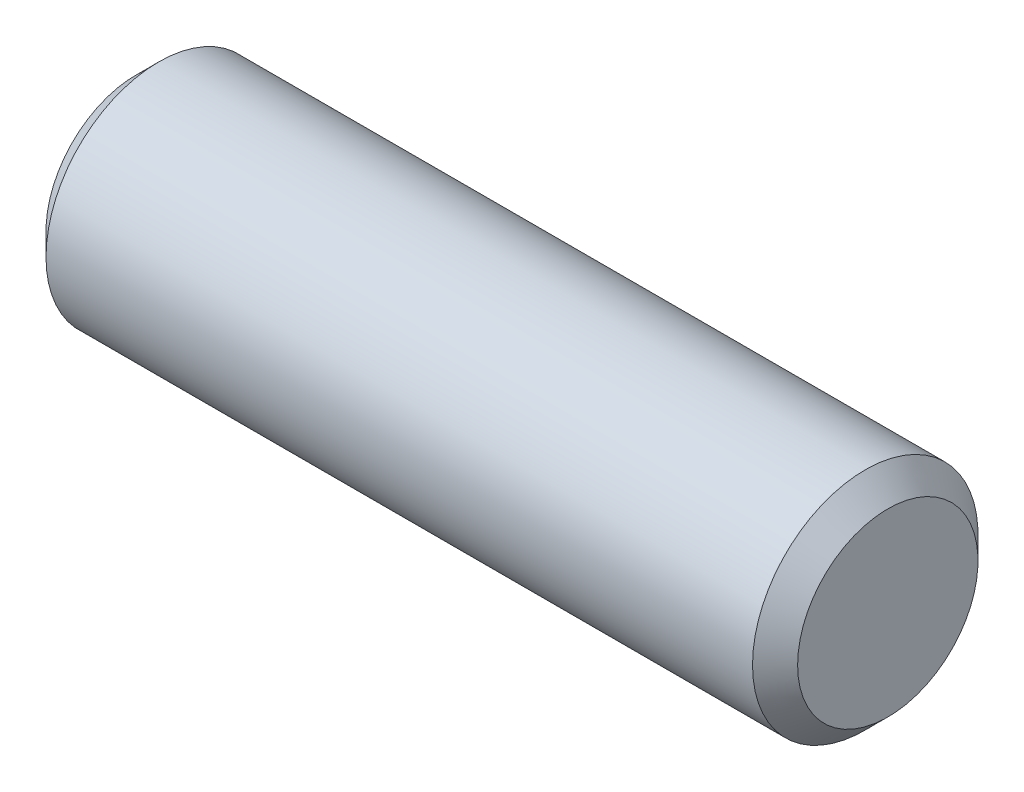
from build123d import *

# Parameters (mm, degrees)
ESQUISSE1_W             = 10
ESQUISSE1_H             = 1.5
ENL_V_MAT_EXTRU_1_DEPTH = 1.5
CHANFREIN1_SIZE         = 0.3


with BuildPart() as part:
    # Esquisse1 → Base-R_volution (revolve)
    with BuildSketch(Plane.XY, mode=Mode.PRIVATE) as base_r_volution_sk:
        with Locations((5, 0.75)):
            Rectangle(ESQUISSE1_W, ESQUISSE1_H)
    revolve(base_r_volution_sk.sketch.rotate(Axis((0, 0, 0), (1, 0, 0)), 90), axis=Axis((0, 0, 0), (1, 0, 0)))

    # Esquisse2 → Enl_v. mat.-Extru.1 (cut)
    with BuildSketch(Plane.ZY):
        Polygon((0.866025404, 0), (0.433012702, 0.75), (-0.433012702, 0.75), (-0.866025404, 0), (-0.433012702, -0.75), (0.433012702, -0.75), align=None)
    extrude(amount=-ENL_V_MAT_EXTRU_1_DEPTH, mode=Mode.SUBTRACT)

    # Chanfrein1
    chanfrein1_edges = [part.edges().sort_by_distance(p)[0] for p in [
        (0, 0, -1.5),
        (10, 0, -1.5),
    ]]
    chamfer(chanfrein1_edges, length=CHANFREIN1_SIZE)


solid = part.part
